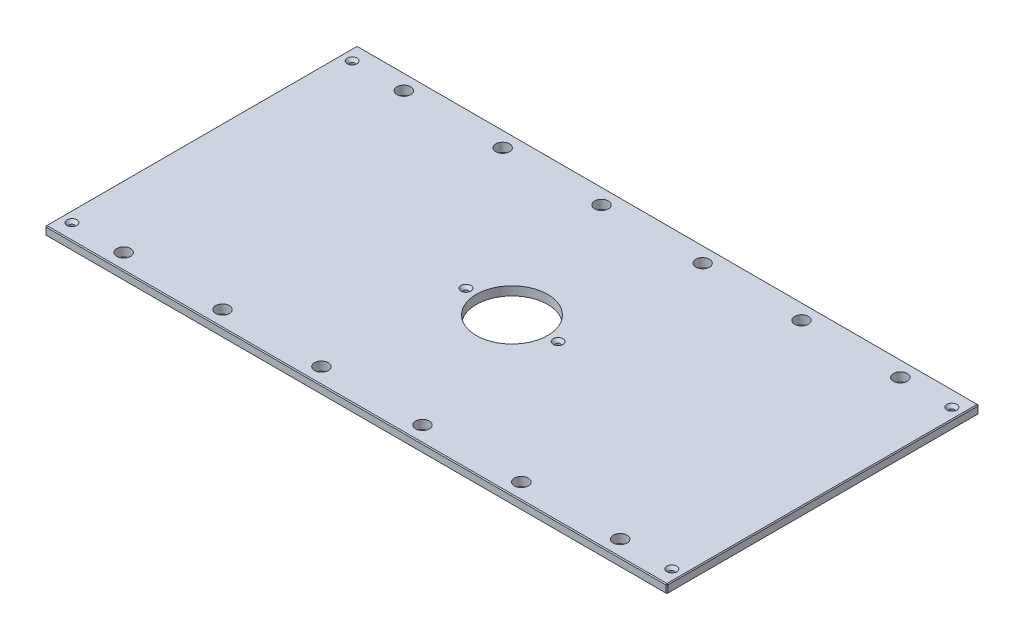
ISO-10303-21;
HEADER;
FILE_DESCRIPTION(('STEP AP214'),'2;1');
FILE_NAME('part.step','',(''),(''),'','','');
FILE_SCHEMA(('AUTOMOTIVE_DESIGN { 1 0 10303 214 1 1 1 1 }'));
ENDSEC;
DATA;
#1=APPLICATION_CONTEXT('core data for automotive mechanical design processes');
#2=APPLICATION_PROTOCOL_DEFINITION('international standard','automotive_design',2000,#1);
#3=PRODUCT_CONTEXT('',#1,'mechanical');
#4=PRODUCT('Part','Part','',(#3));
#5=PRODUCT_RELATED_PRODUCT_CATEGORY('part','',(#4));
#6=PRODUCT_DEFINITION_FORMATION('','',#4);
#7=PRODUCT_DEFINITION_CONTEXT('part definition',#1,'design');
#8=PRODUCT_DEFINITION('design','',#6,#7);
#9=PRODUCT_DEFINITION_SHAPE('','',#8);
#10=(LENGTH_UNIT() NAMED_UNIT(*) SI_UNIT(.MILLI.,.METRE.));
#11=(NAMED_UNIT(*) PLANE_ANGLE_UNIT() SI_UNIT($,.RADIAN.));
#12=(NAMED_UNIT(*) SI_UNIT($,.STERADIAN.) SOLID_ANGLE_UNIT());
#13=UNCERTAINTY_MEASURE_WITH_UNIT(LENGTH_MEASURE(1.E-05),#10,'distance_accuracy_value','');
#14=(GEOMETRIC_REPRESENTATION_CONTEXT(3) GLOBAL_UNCERTAINTY_ASSIGNED_CONTEXT((#13)) GLOBAL_UNIT_ASSIGNED_CONTEXT((#10,
#11,#12)) REPRESENTATION_CONTEXT('',''));
#15=CARTESIAN_POINT('',(0.,0.,0.));
#16=DIRECTION('',(0.,0.,1.));
#17=DIRECTION('',(1.,0.,0.));
#18=AXIS2_PLACEMENT_3D('',#15,#16,#17);
#19=CARTESIAN_POINT('',(-449.2625,12.7,-225.425));
#20=DIRECTION('',(1.,0.,0.));
#21=DIRECTION('',(0.,0.,-1.));
#22=AXIS2_PLACEMENT_3D('',#19,#20,#21);
#23=PLANE('',#22);
#24=DIRECTION('',(0.,0.,-1.));
#25=VECTOR('',#24,1.);
#26=CARTESIAN_POINT('',(-449.2625,11.43,-225.425));
#27=LINE('',#26,#25);
#28=CARTESIAN_POINT('',(-449.2625,11.43,224.155));
#29=VERTEX_POINT('',#28);
#30=CARTESIAN_POINT('',(-449.2625,11.43,-224.155));
#31=VERTEX_POINT('',#30);
#32=EDGE_CURVE('E134',#29,#31,#27,.T.);
#33=ORIENTED_EDGE('',*,*,#32,.T.);
#34=DIRECTION('',(0.,-1.,0.));
#35=VECTOR('',#34,1.);
#36=CARTESIAN_POINT('',(-449.2625,12.7,-224.155));
#37=LINE('',#36,#35);
#38=CARTESIAN_POINT('',(-449.2625,1.26999999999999,-224.155));
#39=VERTEX_POINT('',#38);
#40=EDGE_CURVE('E130',#31,#39,#37,.T.);
#41=ORIENTED_EDGE('',*,*,#40,.T.);
#42=DIRECTION('',(0.,0.,1.));
#43=VECTOR('',#42,1.);
#44=CARTESIAN_POINT('',(-449.2625,1.26999999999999,-225.425));
#45=LINE('',#44,#43);
#46=CARTESIAN_POINT('',(-449.2625,1.26999999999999,224.155));
#47=VERTEX_POINT('',#46);
#48=EDGE_CURVE('E125',#39,#47,#45,.T.);
#49=ORIENTED_EDGE('',*,*,#48,.T.);
#50=DIRECTION('',(0.,1.,0.));
#51=VECTOR('',#50,1.);
#52=CARTESIAN_POINT('',(-449.2625,12.7,224.155));
#53=LINE('',#52,#51);
#54=EDGE_CURVE('E127',#47,#29,#53,.T.);
#55=ORIENTED_EDGE('',*,*,#54,.T.);
#56=EDGE_LOOP('',(#33,#41,#49,#55));
#57=FACE_BOUND('',#56,.T.);
#58=ADVANCED_FACE('F34',(#57),#23,.F.);
#59=CARTESIAN_POINT('',(-449.2625,12.7,225.425));
#60=DIRECTION('',(0.,0.,-1.));
#61=DIRECTION('',(-1.,0.,0.));
#62=AXIS2_PLACEMENT_3D('',#59,#60,#61);
#63=PLANE('',#62);
#64=DIRECTION('',(1.,0.,0.));
#65=VECTOR('',#64,1.);
#66=CARTESIAN_POINT('',(-449.2625,1.26999999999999,225.425));
#67=LINE('',#66,#65);
#68=CARTESIAN_POINT('',(-447.9925,1.26999999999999,225.425));
#69=VERTEX_POINT('',#68);
#70=CARTESIAN_POINT('',(447.9925,1.26999999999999,225.425));
#71=VERTEX_POINT('',#70);
#72=EDGE_CURVE('E57',#69,#71,#67,.T.);
#73=ORIENTED_EDGE('',*,*,#72,.T.);
#74=DIRECTION('',(0.,1.,0.));
#75=VECTOR('',#74,1.);
#76=CARTESIAN_POINT('',(447.9925,12.7,225.425));
#77=LINE('',#76,#75);
#78=CARTESIAN_POINT('',(447.9925,11.43,225.425));
#79=VERTEX_POINT('',#78);
#80=EDGE_CURVE('E11',#71,#79,#77,.T.);
#81=ORIENTED_EDGE('',*,*,#80,.T.);
#82=DIRECTION('',(-1.,0.,0.));
#83=VECTOR('',#82,1.);
#84=CARTESIAN_POINT('',(-449.2625,11.43,225.425));
#85=LINE('',#84,#83);
#86=CARTESIAN_POINT('',(-447.9925,11.43,225.425));
#87=VERTEX_POINT('',#86);
#88=EDGE_CURVE('E43',#79,#87,#85,.T.);
#89=ORIENTED_EDGE('',*,*,#88,.T.);
#90=DIRECTION('',(0.,-1.,0.));
#91=VECTOR('',#90,1.);
#92=CARTESIAN_POINT('',(-447.9925,12.7,225.425));
#93=LINE('',#92,#91);
#94=EDGE_CURVE('E326',#87,#69,#93,.T.);
#95=ORIENTED_EDGE('',*,*,#94,.T.);
#96=EDGE_LOOP('',(#73,#81,#89,#95));
#97=FACE_BOUND('',#96,.T.);
#98=ADVANCED_FACE('F395',(#97),#63,.F.);
#99=CARTESIAN_POINT('',(449.2625,12.7,-225.425));
#100=DIRECTION('',(-1.,0.,0.));
#101=DIRECTION('',(0.,0.,1.));
#102=AXIS2_PLACEMENT_3D('',#99,#100,#101);
#103=PLANE('',#102);
#104=DIRECTION('',(0.,0.,-1.));
#105=VECTOR('',#104,1.);
#106=CARTESIAN_POINT('',(449.2625,1.26999999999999,-225.425));
#107=LINE('',#106,#105);
#108=CARTESIAN_POINT('',(449.2625,1.26999999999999,224.155));
#109=VERTEX_POINT('',#108);
#110=CARTESIAN_POINT('',(449.2625,1.26999999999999,-224.155));
#111=VERTEX_POINT('',#110);
#112=EDGE_CURVE('E321',#109,#111,#107,.T.);
#113=ORIENTED_EDGE('',*,*,#112,.T.);
#114=DIRECTION('',(0.,1.,0.));
#115=VECTOR('',#114,1.);
#116=CARTESIAN_POINT('',(449.2625,12.7,-224.155));
#117=LINE('',#116,#115);
#118=CARTESIAN_POINT('',(449.2625,11.43,-224.155));
#119=VERTEX_POINT('',#118);
#120=EDGE_CURVE('E323',#111,#119,#117,.T.);
#121=ORIENTED_EDGE('',*,*,#120,.T.);
#122=DIRECTION('',(0.,0.,1.));
#123=VECTOR('',#122,1.);
#124=CARTESIAN_POINT('',(449.2625,11.43,225.425));
#125=LINE('',#124,#123);
#126=CARTESIAN_POINT('',(449.2625,11.43,224.155));
#127=VERTEX_POINT('',#126);
#128=EDGE_CURVE('E319',#119,#127,#125,.T.);
#129=ORIENTED_EDGE('',*,*,#128,.T.);
#130=DIRECTION('',(0.,-1.,0.));
#131=VECTOR('',#130,1.);
#132=CARTESIAN_POINT('',(449.2625,12.7,224.155));
#133=LINE('',#132,#131);
#134=EDGE_CURVE('E317',#127,#109,#133,.T.);
#135=ORIENTED_EDGE('',*,*,#134,.T.);
#136=EDGE_LOOP('',(#113,#121,#129,#135));
#137=FACE_BOUND('',#136,.T.);
#138=ADVANCED_FACE('F382',(#137),#103,.F.);
#139=CARTESIAN_POINT('',(-449.2625,12.7,-225.425));
#140=DIRECTION('',(0.,0.,1.));
#141=DIRECTION('',(1.,0.,0.));
#142=AXIS2_PLACEMENT_3D('',#139,#140,#141);
#143=PLANE('',#142);
#144=DIRECTION('',(-1.,0.,0.));
#145=VECTOR('',#144,1.);
#146=CARTESIAN_POINT('',(-449.2625,1.26999999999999,-225.425));
#147=LINE('',#146,#145);
#148=CARTESIAN_POINT('',(447.9925,1.26999999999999,-225.425));
#149=VERTEX_POINT('',#148);
#150=CARTESIAN_POINT('',(-447.9925,1.26999999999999,-225.425));
#151=VERTEX_POINT('',#150);
#152=EDGE_CURVE('E293',#149,#151,#147,.T.);
#153=ORIENTED_EDGE('',*,*,#152,.T.);
#154=DIRECTION('',(0.,1.,0.));
#155=VECTOR('',#154,1.);
#156=CARTESIAN_POINT('',(-447.9925,12.7,-225.425));
#157=LINE('',#156,#155);
#158=CARTESIAN_POINT('',(-447.9925,11.43,-225.425));
#159=VERTEX_POINT('',#158);
#160=EDGE_CURVE('E297',#151,#159,#157,.T.);
#161=ORIENTED_EDGE('',*,*,#160,.T.);
#162=DIRECTION('',(1.,0.,0.));
#163=VECTOR('',#162,1.);
#164=CARTESIAN_POINT('',(449.2625,11.43,-225.425));
#165=LINE('',#164,#163);
#166=CARTESIAN_POINT('',(447.9925,11.43,-225.425));
#167=VERTEX_POINT('',#166);
#168=EDGE_CURVE('E295',#159,#167,#165,.T.);
#169=ORIENTED_EDGE('',*,*,#168,.T.);
#170=DIRECTION('',(0.,-1.,0.));
#171=VECTOR('',#170,1.);
#172=CARTESIAN_POINT('',(447.9925,12.7,-225.425));
#173=LINE('',#172,#171);
#174=EDGE_CURVE('E291',#167,#149,#173,.T.);
#175=ORIENTED_EDGE('',*,*,#174,.T.);
#176=EDGE_LOOP('',(#153,#161,#169,#175));
#177=FACE_BOUND('',#176,.T.);
#178=ADVANCED_FACE('F356',(#177),#143,.F.);
#179=CARTESIAN_POINT('',(0.,12.7,0.));
#180=DIRECTION('',(0.,1.,0.));
#181=DIRECTION('',(0.,0.,1.));
#182=AXIS2_PLACEMENT_3D('',#179,#180,#181);
#183=PLANE('',#182);
#184=CARTESIAN_POINT('',(433.3875,12.7,-202.40498));
#185=DIRECTION('',(0.,1.,0.));
#186=DIRECTION('',(0.,0.,1.));
#187=AXIS2_PLACEMENT_3D('',#184,#185,#186);
#188=CIRCLE('',#187,7.13740000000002);
#189=CARTESIAN_POINT('',(433.3875,12.7,-195.26758));
#190=VERTEX_POINT('',#189);
#191=EDGE_CURVE('E879',#190,#190,#188,.T.);
#192=ORIENTED_EDGE('',*,*,#191,.F.);
#193=EDGE_LOOP('',(#192));
#194=FACE_BOUND('',#193,.T.);
#195=CARTESIAN_POINT('',(433.3875,12.7,202.40498));
#196=DIRECTION('',(0.,1.,0.));
#197=DIRECTION('',(0.,0.,1.));
#198=AXIS2_PLACEMENT_3D('',#195,#196,#197);
#199=CIRCLE('',#198,7.13740000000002);
#200=CARTESIAN_POINT('',(433.3875,12.7,209.54238));
#201=VERTEX_POINT('',#200);
#202=EDGE_CURVE('E883',#201,#201,#199,.T.);
#203=ORIENTED_EDGE('',*,*,#202,.F.);
#204=EDGE_LOOP('',(#203));
#205=FACE_BOUND('',#204,.T.);
#206=CARTESIAN_POINT('',(-433.3875,12.7,202.40498));
#207=DIRECTION('',(0.,1.,0.));
#208=DIRECTION('',(0.,0.,1.));
#209=AXIS2_PLACEMENT_3D('',#206,#207,#208);
#210=CIRCLE('',#209,7.13740000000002);
#211=CARTESIAN_POINT('',(-433.3875,12.7,209.54238));
#212=VERTEX_POINT('',#211);
#213=EDGE_CURVE('E887',#212,#212,#210,.T.);
#214=ORIENTED_EDGE('',*,*,#213,.F.);
#215=EDGE_LOOP('',(#214));
#216=FACE_BOUND('',#215,.T.);
#217=CARTESIAN_POINT('',(-66.675,12.7,0.));
#218=DIRECTION('',(0.,1.,0.));
#219=DIRECTION('',(0.,0.,1.));
#220=AXIS2_PLACEMENT_3D('',#217,#218,#219);
#221=CIRCLE('',#220,7.1374);
#222=CARTESIAN_POINT('',(-66.675,12.7,7.1374));
#223=VERTEX_POINT('',#222);
#224=EDGE_CURVE('E891',#223,#223,#221,.T.);
#225=ORIENTED_EDGE('',*,*,#224,.F.);
#226=EDGE_LOOP('',(#225));
#227=FACE_BOUND('',#226,.T.);
#228=CARTESIAN_POINT('',(66.675,12.7,0.));
#229=DIRECTION('',(0.,1.,0.));
#230=DIRECTION('',(0.,0.,1.));
#231=AXIS2_PLACEMENT_3D('',#228,#229,#230);
#232=CIRCLE('',#231,7.1374);
#233=CARTESIAN_POINT('',(66.675,12.7,7.1374));
#234=VERTEX_POINT('',#233);
#235=EDGE_CURVE('E895',#234,#234,#232,.T.);
#236=ORIENTED_EDGE('',*,*,#235,.F.);
#237=EDGE_LOOP('',(#236));
#238=FACE_BOUND('',#237,.T.);
#239=CARTESIAN_POINT('',(-433.3875,12.7,-202.40498));
#240=DIRECTION('',(0.,1.,0.));
#241=DIRECTION('',(0.,0.,1.));
#242=AXIS2_PLACEMENT_3D('',#239,#240,#241);
#243=CIRCLE('',#242,7.13740000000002);
#244=CARTESIAN_POINT('',(-433.3875,12.7,-195.26758));
#245=VERTEX_POINT('',#244);
#246=EDGE_CURVE('E898',#245,#245,#243,.T.);
#247=ORIENTED_EDGE('',*,*,#246,.F.);
#248=EDGE_LOOP('',(#247));
#249=FACE_BOUND('',#248,.T.);
#250=DIRECTION('',(0.,0.,-1.));
#251=VECTOR('',#250,1.);
#252=CARTESIAN_POINT('',(447.9925,12.7,-225.425));
#253=LINE('',#252,#251);
#254=CARTESIAN_POINT('',(447.9925,12.7,224.155));
#255=VERTEX_POINT('',#254);
#256=CARTESIAN_POINT('',(447.9925,12.7,-224.155));
#257=VERTEX_POINT('',#256);
#258=EDGE_CURVE('E304',#255,#257,#253,.T.);
#259=ORIENTED_EDGE('',*,*,#258,.T.);
#260=DIRECTION('',(-1.,0.,0.));
#261=VECTOR('',#260,1.);
#262=CARTESIAN_POINT('',(-449.2625,12.7,-224.155));
#263=LINE('',#262,#261);
#264=CARTESIAN_POINT('',(-447.9925,12.7,-224.155));
#265=VERTEX_POINT('',#264);
#266=EDGE_CURVE('E306',#257,#265,#263,.T.);
#267=ORIENTED_EDGE('',*,*,#266,.T.);
#268=DIRECTION('',(0.,0.,1.));
#269=VECTOR('',#268,1.);
#270=CARTESIAN_POINT('',(-447.9925,12.7,225.425));
#271=LINE('',#270,#269);
#272=CARTESIAN_POINT('',(-447.9925,12.7,224.155));
#273=VERTEX_POINT('',#272);
#274=EDGE_CURVE('E302',#265,#273,#271,.T.);
#275=ORIENTED_EDGE('',*,*,#274,.T.);
#276=DIRECTION('',(1.,0.,0.));
#277=VECTOR('',#276,1.);
#278=CARTESIAN_POINT('',(449.2625,12.7,224.155));
#279=LINE('',#278,#277);
#280=EDGE_CURVE('E300',#273,#255,#279,.T.);
#281=ORIENTED_EDGE('',*,*,#280,.T.);
#282=EDGE_LOOP('',(#259,#267,#275,#281));
#283=FACE_BOUND('',#282,.T.);
#284=CARTESIAN_POINT('',(358.775,12.7,-202.40498));
#285=DIRECTION('',(0.,1.,0.));
#286=DIRECTION('',(0.,0.,1.));
#287=AXIS2_PLACEMENT_3D('',#284,#285,#286);
#288=CIRCLE('',#287,9.92187500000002);
#289=CARTESIAN_POINT('',(358.775,12.7,-192.483105));
#290=VERTEX_POINT('',#289);
#291=EDGE_CURVE('E203',#290,#290,#288,.T.);
#292=ORIENTED_EDGE('',*,*,#291,.F.);
#293=EDGE_LOOP('',(#292));
#294=FACE_BOUND('',#293,.T.);
#295=CARTESIAN_POINT('',(-358.775,12.7,-202.40498));
#296=DIRECTION('',(0.,1.,0.));
#297=DIRECTION('',(0.,0.,1.));
#298=AXIS2_PLACEMENT_3D('',#295,#296,#297);
#299=CIRCLE('',#298,9.92187500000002);
#300=CARTESIAN_POINT('',(-358.775,12.7,-192.483105));
#301=VERTEX_POINT('',#300);
#302=EDGE_CURVE('E213',#301,#301,#299,.T.);
#303=ORIENTED_EDGE('',*,*,#302,.F.);
#304=EDGE_LOOP('',(#303));
#305=FACE_BOUND('',#304,.T.);
#306=CARTESIAN_POINT('',(358.775,12.7,202.40498));
#307=DIRECTION('',(0.,1.,0.));
#308=DIRECTION('',(0.,0.,1.));
#309=AXIS2_PLACEMENT_3D('',#306,#307,#308);
#310=CIRCLE('',#309,9.92187500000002);
#311=CARTESIAN_POINT('',(358.775,12.7,212.326855));
#312=VERTEX_POINT('',#311);
#313=EDGE_CURVE('E224',#312,#312,#310,.T.);
#314=ORIENTED_EDGE('',*,*,#313,.F.);
#315=EDGE_LOOP('',(#314));
#316=FACE_BOUND('',#315,.T.);
#317=CARTESIAN_POINT('',(-358.775,12.7,202.40498));
#318=DIRECTION('',(0.,1.,0.));
#319=DIRECTION('',(0.,0.,1.));
#320=AXIS2_PLACEMENT_3D('',#317,#318,#319);
#321=CIRCLE('',#320,9.92187500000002);
#322=CARTESIAN_POINT('',(-358.775,12.7,212.326855));
#323=VERTEX_POINT('',#322);
#324=EDGE_CURVE('E230',#323,#323,#321,.T.);
#325=ORIENTED_EDGE('',*,*,#324,.F.);
#326=EDGE_LOOP('',(#325));
#327=FACE_BOUND('',#326,.T.);
#328=CARTESIAN_POINT('',(-215.9,12.7,-202.40498));
#329=DIRECTION('',(0.,1.,0.));
#330=DIRECTION('',(0.,0.,1.));
#331=AXIS2_PLACEMENT_3D('',#328,#329,#330);
#332=CIRCLE('',#331,9.921875);
#333=CARTESIAN_POINT('',(-215.9,12.7,-192.483105));
#334=VERTEX_POINT('',#333);
#335=EDGE_CURVE('E236',#334,#334,#332,.T.);
#336=ORIENTED_EDGE('',*,*,#335,.F.);
#337=EDGE_LOOP('',(#336));
#338=FACE_BOUND('',#337,.T.);
#339=CARTESIAN_POINT('',(215.9,12.7,-202.40498));
#340=DIRECTION('',(0.,1.,0.));
#341=DIRECTION('',(0.,0.,1.));
#342=AXIS2_PLACEMENT_3D('',#339,#340,#341);
#343=CIRCLE('',#342,9.921875);
#344=CARTESIAN_POINT('',(215.9,12.7,-192.483105));
#345=VERTEX_POINT('',#344);
#346=EDGE_CURVE('E242',#345,#345,#343,.T.);
#347=ORIENTED_EDGE('',*,*,#346,.F.);
#348=EDGE_LOOP('',(#347));
#349=FACE_BOUND('',#348,.T.);
#350=CARTESIAN_POINT('',(215.9,12.7,202.40498));
#351=DIRECTION('',(0.,1.,0.));
#352=DIRECTION('',(0.,0.,1.));
#353=AXIS2_PLACEMENT_3D('',#350,#351,#352);
#354=CIRCLE('',#353,9.921875);
#355=CARTESIAN_POINT('',(215.9,12.7,212.326855));
#356=VERTEX_POINT('',#355);
#357=EDGE_CURVE('E248',#356,#356,#354,.T.);
#358=ORIENTED_EDGE('',*,*,#357,.F.);
#359=EDGE_LOOP('',(#358));
#360=FACE_BOUND('',#359,.T.);
#361=CARTESIAN_POINT('',(-215.9,12.7,202.40498));
#362=DIRECTION('',(0.,1.,0.));
#363=DIRECTION('',(0.,0.,1.));
#364=AXIS2_PLACEMENT_3D('',#361,#362,#363);
#365=CIRCLE('',#364,9.921875);
#366=CARTESIAN_POINT('',(-215.9,12.7,212.326855));
#367=VERTEX_POINT('',#366);
#368=EDGE_CURVE('E254',#367,#367,#365,.T.);
#369=ORIENTED_EDGE('',*,*,#368,.F.);
#370=EDGE_LOOP('',(#369));
#371=FACE_BOUND('',#370,.T.);
#372=CARTESIAN_POINT('',(73.025,12.7,-202.40498));
#373=DIRECTION('',(0.,1.,0.));
#374=DIRECTION('',(0.,0.,1.));
#375=AXIS2_PLACEMENT_3D('',#372,#373,#374);
#376=CIRCLE('',#375,9.921875);
#377=CARTESIAN_POINT('',(73.025,12.7,-192.483105));
#378=VERTEX_POINT('',#377);
#379=EDGE_CURVE('E260',#378,#378,#376,.T.);
#380=ORIENTED_EDGE('',*,*,#379,.F.);
#381=EDGE_LOOP('',(#380));
#382=FACE_BOUND('',#381,.T.);
#383=CARTESIAN_POINT('',(-73.025,12.7,-202.40498));
#384=DIRECTION('',(0.,1.,0.));
#385=DIRECTION('',(0.,0.,1.));
#386=AXIS2_PLACEMENT_3D('',#383,#384,#385);
#387=CIRCLE('',#386,9.921875);
#388=CARTESIAN_POINT('',(-73.025,12.7,-192.483105));
#389=VERTEX_POINT('',#388);
#390=EDGE_CURVE('E266',#389,#389,#387,.T.);
#391=ORIENTED_EDGE('',*,*,#390,.F.);
#392=EDGE_LOOP('',(#391));
#393=FACE_BOUND('',#392,.T.);
#394=CARTESIAN_POINT('',(-73.025,12.7,202.40498));
#395=DIRECTION('',(0.,1.,0.));
#396=DIRECTION('',(0.,0.,1.));
#397=AXIS2_PLACEMENT_3D('',#394,#395,#396);
#398=CIRCLE('',#397,9.921875);
#399=CARTESIAN_POINT('',(-73.025,12.7,212.326855));
#400=VERTEX_POINT('',#399);
#401=EDGE_CURVE('E272',#400,#400,#398,.T.);
#402=ORIENTED_EDGE('',*,*,#401,.F.);
#403=EDGE_LOOP('',(#402));
#404=FACE_BOUND('',#403,.T.);
#405=CARTESIAN_POINT('',(73.025,12.7,202.40498));
#406=DIRECTION('',(0.,1.,0.));
#407=DIRECTION('',(0.,0.,1.));
#408=AXIS2_PLACEMENT_3D('',#405,#406,#407);
#409=CIRCLE('',#408,9.921875);
#410=CARTESIAN_POINT('',(73.025,12.7,212.326855));
#411=VERTEX_POINT('',#410);
#412=EDGE_CURVE('E278',#411,#411,#409,.T.);
#413=ORIENTED_EDGE('',*,*,#412,.F.);
#414=EDGE_LOOP('',(#413));
#415=FACE_BOUND('',#414,.T.);
#416=CARTESIAN_POINT('',(0.,12.7,0.));
#417=DIRECTION('',(0.,1.,0.));
#418=DIRECTION('',(0.,0.,1.));
#419=AXIS2_PLACEMENT_3D('',#416,#417,#418);
#420=CIRCLE('',#419,51.562);
#421=CARTESIAN_POINT('',(0.,12.7,51.562));
#422=VERTEX_POINT('',#421);
#423=EDGE_CURVE('E284',#422,#422,#420,.T.);
#424=ORIENTED_EDGE('',*,*,#423,.F.);
#425=EDGE_LOOP('',(#424));
#426=FACE_BOUND('',#425,.T.);
#427=ADVANCED_FACE('F404',(#194,#205,#216,#227,#238,#249,#283,#294,#305,#316,#327,#338,#349,
#360,#371,#382,#393,#404,#415,#426),#183,.T.);
#428=CARTESIAN_POINT('',(0.,0.,0.));
#429=DIRECTION('',(0.,1.,0.));
#430=DIRECTION('',(0.,0.,1.));
#431=AXIS2_PLACEMENT_3D('',#428,#429,#430);
#432=PLANE('',#431);
#433=CARTESIAN_POINT('',(433.3875,0.,-202.40498));
#434=DIRECTION('',(0.,1.,0.));
#435=DIRECTION('',(0.,0.,1.));
#436=AXIS2_PLACEMENT_3D('',#433,#434,#435);
#437=CIRCLE('',#436,3.3782);
#438=CARTESIAN_POINT('',(433.3875,0.,-199.02678));
#439=VERTEX_POINT('',#438);
#440=EDGE_CURVE('E932',#439,#439,#437,.T.);
#441=ORIENTED_EDGE('',*,*,#440,.T.);
#442=EDGE_LOOP('',(#441));
#443=FACE_BOUND('',#442,.T.);
#444=CARTESIAN_POINT('',(433.3875,0.,202.40498));
#445=DIRECTION('',(0.,1.,0.));
#446=DIRECTION('',(0.,0.,1.));
#447=AXIS2_PLACEMENT_3D('',#444,#445,#446);
#448=CIRCLE('',#447,3.3782);
#449=CARTESIAN_POINT('',(433.3875,0.,205.78318));
#450=VERTEX_POINT('',#449);
#451=EDGE_CURVE('E925',#450,#450,#448,.T.);
#452=ORIENTED_EDGE('',*,*,#451,.T.);
#453=EDGE_LOOP('',(#452));
#454=FACE_BOUND('',#453,.T.);
#455=CARTESIAN_POINT('',(-433.3875,0.,202.40498));
#456=DIRECTION('',(0.,1.,0.));
#457=DIRECTION('',(0.,0.,1.));
#458=AXIS2_PLACEMENT_3D('',#455,#456,#457);
#459=CIRCLE('',#458,3.3782);
#460=CARTESIAN_POINT('',(-433.3875,0.,205.78318));
#461=VERTEX_POINT('',#460);
#462=EDGE_CURVE('E918',#461,#461,#459,.T.);
#463=ORIENTED_EDGE('',*,*,#462,.T.);
#464=EDGE_LOOP('',(#463));
#465=FACE_BOUND('',#464,.T.);
#466=CARTESIAN_POINT('',(-66.675,0.,0.));
#467=DIRECTION('',(0.,1.,0.));
#468=DIRECTION('',(0.,0.,1.));
#469=AXIS2_PLACEMENT_3D('',#466,#467,#468);
#470=CIRCLE('',#469,3.3782);
#471=CARTESIAN_POINT('',(-66.675,0.,3.3782));
#472=VERTEX_POINT('',#471);
#473=EDGE_CURVE('E911',#472,#472,#470,.T.);
#474=ORIENTED_EDGE('',*,*,#473,.T.);
#475=EDGE_LOOP('',(#474));
#476=FACE_BOUND('',#475,.T.);
#477=CARTESIAN_POINT('',(66.675,0.,0.));
#478=DIRECTION('',(0.,1.,0.));
#479=DIRECTION('',(0.,0.,1.));
#480=AXIS2_PLACEMENT_3D('',#477,#478,#479);
#481=CIRCLE('',#480,3.3782);
#482=CARTESIAN_POINT('',(66.675,0.,3.3782));
#483=VERTEX_POINT('',#482);
#484=EDGE_CURVE('E901',#483,#483,#481,.T.);
#485=ORIENTED_EDGE('',*,*,#484,.T.);
#486=EDGE_LOOP('',(#485));
#487=FACE_BOUND('',#486,.T.);
#488=CARTESIAN_POINT('',(-433.3875,0.,-202.40498));
#489=DIRECTION('',(0.,1.,0.));
#490=DIRECTION('',(0.,0.,1.));
#491=AXIS2_PLACEMENT_3D('',#488,#489,#490);
#492=CIRCLE('',#491,3.3782);
#493=CARTESIAN_POINT('',(-433.3875,0.,-199.02678));
#494=VERTEX_POINT('',#493);
#495=EDGE_CURVE('E216',#494,#494,#492,.T.);
#496=ORIENTED_EDGE('',*,*,#495,.T.);
#497=EDGE_LOOP('',(#496));
#498=FACE_BOUND('',#497,.T.);
#499=DIRECTION('',(0.,0.,-1.));
#500=VECTOR('',#499,1.);
#501=CARTESIAN_POINT('',(-447.9925,0.,0.));
#502=LINE('',#501,#500);
#503=CARTESIAN_POINT('',(-447.9925,0.,224.155));
#504=VERTEX_POINT('',#503);
#505=CARTESIAN_POINT('',(-447.9925,0.,-224.155));
#506=VERTEX_POINT('',#505);
#507=EDGE_CURVE('E157',#504,#506,#502,.T.);
#508=ORIENTED_EDGE('',*,*,#507,.T.);
#509=DIRECTION('',(1.,0.,0.));
#510=VECTOR('',#509,1.);
#511=CARTESIAN_POINT('',(0.,0.,-224.155));
#512=LINE('',#511,#510);
#513=CARTESIAN_POINT('',(447.9925,0.,-224.155));
#514=VERTEX_POINT('',#513);
#515=EDGE_CURVE('E314',#506,#514,#512,.T.);
#516=ORIENTED_EDGE('',*,*,#515,.T.);
#517=DIRECTION('',(0.,0.,1.));
#518=VECTOR('',#517,1.);
#519=CARTESIAN_POINT('',(447.9925,0.,0.));
#520=LINE('',#519,#518);
#521=CARTESIAN_POINT('',(447.9925,0.,224.155));
#522=VERTEX_POINT('',#521);
#523=EDGE_CURVE('E312',#514,#522,#520,.T.);
#524=ORIENTED_EDGE('',*,*,#523,.T.);
#525=DIRECTION('',(-1.,0.,0.));
#526=VECTOR('',#525,1.);
#527=CARTESIAN_POINT('',(0.,0.,224.155));
#528=LINE('',#527,#526);
#529=EDGE_CURVE('E309',#522,#504,#528,.T.);
#530=ORIENTED_EDGE('',*,*,#529,.T.);
#531=EDGE_LOOP('',(#508,#516,#524,#530));
#532=FACE_BOUND('',#531,.T.);
#533=CARTESIAN_POINT('',(358.775,0.,-202.40498));
#534=DIRECTION('',(0.,1.,0.));
#535=DIRECTION('',(0.,0.,1.));
#536=AXIS2_PLACEMENT_3D('',#533,#534,#535);
#537=CIRCLE('',#536,9.92187500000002);
#538=CARTESIAN_POINT('',(358.775,0.,-192.483105));
#539=VERTEX_POINT('',#538);
#540=EDGE_CURVE('E208',#539,#539,#537,.T.);
#541=ORIENTED_EDGE('',*,*,#540,.T.);
#542=EDGE_LOOP('',(#541));
#543=FACE_BOUND('',#542,.T.);
#544=CARTESIAN_POINT('',(-358.775,0.,-202.40498));
#545=DIRECTION('',(0.,1.,0.));
#546=DIRECTION('',(0.,0.,1.));
#547=AXIS2_PLACEMENT_3D('',#544,#545,#546);
#548=CIRCLE('',#547,9.92187500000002);
#549=CARTESIAN_POINT('',(-358.775,0.,-192.483105));
#550=VERTEX_POINT('',#549);
#551=EDGE_CURVE('E221',#550,#550,#548,.T.);
#552=ORIENTED_EDGE('',*,*,#551,.T.);
#553=EDGE_LOOP('',(#552));
#554=FACE_BOUND('',#553,.T.);
#555=CARTESIAN_POINT('',(358.775,0.,202.40498));
#556=DIRECTION('',(0.,1.,0.));
#557=DIRECTION('',(0.,0.,1.));
#558=AXIS2_PLACEMENT_3D('',#555,#556,#557);
#559=CIRCLE('',#558,9.92187500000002);
#560=CARTESIAN_POINT('',(358.775,0.,212.326855));
#561=VERTEX_POINT('',#560);
#562=EDGE_CURVE('E227',#561,#561,#559,.T.);
#563=ORIENTED_EDGE('',*,*,#562,.T.);
#564=EDGE_LOOP('',(#563));
#565=FACE_BOUND('',#564,.T.);
#566=CARTESIAN_POINT('',(-358.775,0.,202.40498));
#567=DIRECTION('',(0.,1.,0.));
#568=DIRECTION('',(0.,0.,1.));
#569=AXIS2_PLACEMENT_3D('',#566,#567,#568);
#570=CIRCLE('',#569,9.92187500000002);
#571=CARTESIAN_POINT('',(-358.775,0.,212.326855));
#572=VERTEX_POINT('',#571);
#573=EDGE_CURVE('E233',#572,#572,#570,.T.);
#574=ORIENTED_EDGE('',*,*,#573,.T.);
#575=EDGE_LOOP('',(#574));
#576=FACE_BOUND('',#575,.T.);
#577=CARTESIAN_POINT('',(-215.9,0.,-202.40498));
#578=DIRECTION('',(0.,1.,0.));
#579=DIRECTION('',(0.,0.,1.));
#580=AXIS2_PLACEMENT_3D('',#577,#578,#579);
#581=CIRCLE('',#580,9.921875);
#582=CARTESIAN_POINT('',(-215.9,0.,-192.483105));
#583=VERTEX_POINT('',#582);
#584=EDGE_CURVE('E239',#583,#583,#581,.T.);
#585=ORIENTED_EDGE('',*,*,#584,.T.);
#586=EDGE_LOOP('',(#585));
#587=FACE_BOUND('',#586,.T.);
#588=CARTESIAN_POINT('',(215.9,0.,-202.40498));
#589=DIRECTION('',(0.,1.,0.));
#590=DIRECTION('',(0.,0.,1.));
#591=AXIS2_PLACEMENT_3D('',#588,#589,#590);
#592=CIRCLE('',#591,9.921875);
#593=CARTESIAN_POINT('',(215.9,0.,-192.483105));
#594=VERTEX_POINT('',#593);
#595=EDGE_CURVE('E245',#594,#594,#592,.T.);
#596=ORIENTED_EDGE('',*,*,#595,.T.);
#597=EDGE_LOOP('',(#596));
#598=FACE_BOUND('',#597,.T.);
#599=CARTESIAN_POINT('',(215.9,0.,202.40498));
#600=DIRECTION('',(0.,1.,0.));
#601=DIRECTION('',(0.,0.,1.));
#602=AXIS2_PLACEMENT_3D('',#599,#600,#601);
#603=CIRCLE('',#602,9.921875);
#604=CARTESIAN_POINT('',(215.9,0.,212.326855));
#605=VERTEX_POINT('',#604);
#606=EDGE_CURVE('E251',#605,#605,#603,.T.);
#607=ORIENTED_EDGE('',*,*,#606,.T.);
#608=EDGE_LOOP('',(#607));
#609=FACE_BOUND('',#608,.T.);
#610=CARTESIAN_POINT('',(-215.9,0.,202.40498));
#611=DIRECTION('',(0.,1.,0.));
#612=DIRECTION('',(0.,0.,1.));
#613=AXIS2_PLACEMENT_3D('',#610,#611,#612);
#614=CIRCLE('',#613,9.921875);
#615=CARTESIAN_POINT('',(-215.9,0.,212.326855));
#616=VERTEX_POINT('',#615);
#617=EDGE_CURVE('E257',#616,#616,#614,.T.);
#618=ORIENTED_EDGE('',*,*,#617,.T.);
#619=EDGE_LOOP('',(#618));
#620=FACE_BOUND('',#619,.T.);
#621=CARTESIAN_POINT('',(73.025,0.,-202.40498));
#622=DIRECTION('',(0.,1.,0.));
#623=DIRECTION('',(0.,0.,1.));
#624=AXIS2_PLACEMENT_3D('',#621,#622,#623);
#625=CIRCLE('',#624,9.921875);
#626=CARTESIAN_POINT('',(73.025,0.,-192.483105));
#627=VERTEX_POINT('',#626);
#628=EDGE_CURVE('E263',#627,#627,#625,.T.);
#629=ORIENTED_EDGE('',*,*,#628,.T.);
#630=EDGE_LOOP('',(#629));
#631=FACE_BOUND('',#630,.T.);
#632=CARTESIAN_POINT('',(-73.025,0.,-202.40498));
#633=DIRECTION('',(0.,1.,0.));
#634=DIRECTION('',(0.,0.,1.));
#635=AXIS2_PLACEMENT_3D('',#632,#633,#634);
#636=CIRCLE('',#635,9.921875);
#637=CARTESIAN_POINT('',(-73.025,0.,-192.483105));
#638=VERTEX_POINT('',#637);
#639=EDGE_CURVE('E269',#638,#638,#636,.T.);
#640=ORIENTED_EDGE('',*,*,#639,.T.);
#641=EDGE_LOOP('',(#640));
#642=FACE_BOUND('',#641,.T.);
#643=CARTESIAN_POINT('',(-73.025,0.,202.40498));
#644=DIRECTION('',(0.,1.,0.));
#645=DIRECTION('',(0.,0.,1.));
#646=AXIS2_PLACEMENT_3D('',#643,#644,#645);
#647=CIRCLE('',#646,9.921875);
#648=CARTESIAN_POINT('',(-73.025,0.,212.326855));
#649=VERTEX_POINT('',#648);
#650=EDGE_CURVE('E275',#649,#649,#647,.T.);
#651=ORIENTED_EDGE('',*,*,#650,.T.);
#652=EDGE_LOOP('',(#651));
#653=FACE_BOUND('',#652,.T.);
#654=CARTESIAN_POINT('',(73.025,0.,202.40498));
#655=DIRECTION('',(0.,1.,0.));
#656=DIRECTION('',(0.,0.,1.));
#657=AXIS2_PLACEMENT_3D('',#654,#655,#656);
#658=CIRCLE('',#657,9.921875);
#659=CARTESIAN_POINT('',(73.025,0.,212.326855));
#660=VERTEX_POINT('',#659);
#661=EDGE_CURVE('E281',#660,#660,#658,.T.);
#662=ORIENTED_EDGE('',*,*,#661,.T.);
#663=EDGE_LOOP('',(#662));
#664=FACE_BOUND('',#663,.T.);
#665=CARTESIAN_POINT('',(0.,0.,0.));
#666=DIRECTION('',(0.,1.,0.));
#667=DIRECTION('',(0.,0.,1.));
#668=AXIS2_PLACEMENT_3D('',#665,#666,#667);
#669=CIRCLE('',#668,51.562);
#670=CARTESIAN_POINT('',(0.,0.,51.562));
#671=VERTEX_POINT('',#670);
#672=EDGE_CURVE('E146',#671,#671,#669,.T.);
#673=ORIENTED_EDGE('',*,*,#672,.T.);
#674=EDGE_LOOP('',(#673));
#675=FACE_BOUND('',#674,.T.);
#676=ADVANCED_FACE('F369',(#443,#454,#465,#476,#487,#498,#532,#543,#554,#565,#576,#587,#598,
#609,#620,#631,#642,#653,#664,#675),#432,.F.);
#677=CARTESIAN_POINT('',(0.,0.,0.));
#678=DIRECTION('',(0.,1.,0.));
#679=DIRECTION('',(0.,0.,1.));
#680=AXIS2_PLACEMENT_3D('',#677,#678,#679);
#681=CYLINDRICAL_SURFACE('',#680,51.562);
#682=ORIENTED_EDGE('',*,*,#672,.F.);
#683=EDGE_LOOP('',(#682));
#684=FACE_BOUND('',#683,.T.);
#685=ORIENTED_EDGE('',*,*,#423,.T.);
#686=EDGE_LOOP('',(#685));
#687=FACE_BOUND('',#686,.T.);
#688=ADVANCED_FACE('F810',(#684,#687),#681,.F.);
#689=CARTESIAN_POINT('',(73.025,12.7,202.40498));
#690=DIRECTION('',(0.,1.,0.));
#691=DIRECTION('',(0.,0.,1.));
#692=AXIS2_PLACEMENT_3D('',#689,#690,#691);
#693=CYLINDRICAL_SURFACE('',#692,9.921875);
#694=ORIENTED_EDGE('',*,*,#661,.F.);
#695=EDGE_LOOP('',(#694));
#696=FACE_BOUND('',#695,.T.);
#697=ORIENTED_EDGE('',*,*,#412,.T.);
#698=EDGE_LOOP('',(#697));
#699=FACE_BOUND('',#698,.T.);
#700=ADVANCED_FACE('F801',(#696,#699),#693,.F.);
#701=CARTESIAN_POINT('',(-73.025,12.7,202.40498));
#702=DIRECTION('',(0.,1.,0.));
#703=DIRECTION('',(0.,0.,1.));
#704=AXIS2_PLACEMENT_3D('',#701,#702,#703);
#705=CYLINDRICAL_SURFACE('',#704,9.921875);
#706=ORIENTED_EDGE('',*,*,#650,.F.);
#707=EDGE_LOOP('',(#706));
#708=FACE_BOUND('',#707,.T.);
#709=ORIENTED_EDGE('',*,*,#401,.T.);
#710=EDGE_LOOP('',(#709));
#711=FACE_BOUND('',#710,.T.);
#712=ADVANCED_FACE('F792',(#708,#711),#705,.F.);
#713=CARTESIAN_POINT('',(-73.025,12.7,-202.40498));
#714=DIRECTION('',(0.,1.,0.));
#715=DIRECTION('',(0.,0.,1.));
#716=AXIS2_PLACEMENT_3D('',#713,#714,#715);
#717=CYLINDRICAL_SURFACE('',#716,9.921875);
#718=ORIENTED_EDGE('',*,*,#639,.F.);
#719=EDGE_LOOP('',(#718));
#720=FACE_BOUND('',#719,.T.);
#721=ORIENTED_EDGE('',*,*,#390,.T.);
#722=EDGE_LOOP('',(#721));
#723=FACE_BOUND('',#722,.T.);
#724=ADVANCED_FACE('F783',(#720,#723),#717,.F.);
#725=CARTESIAN_POINT('',(73.025,12.7,-202.40498));
#726=DIRECTION('',(0.,1.,0.));
#727=DIRECTION('',(0.,0.,1.));
#728=AXIS2_PLACEMENT_3D('',#725,#726,#727);
#729=CYLINDRICAL_SURFACE('',#728,9.921875);
#730=ORIENTED_EDGE('',*,*,#628,.F.);
#731=EDGE_LOOP('',(#730));
#732=FACE_BOUND('',#731,.T.);
#733=ORIENTED_EDGE('',*,*,#379,.T.);
#734=EDGE_LOOP('',(#733));
#735=FACE_BOUND('',#734,.T.);
#736=ADVANCED_FACE('F774',(#732,#735),#729,.F.);
#737=CARTESIAN_POINT('',(-215.9,12.7,202.40498));
#738=DIRECTION('',(0.,1.,0.));
#739=DIRECTION('',(0.,0.,1.));
#740=AXIS2_PLACEMENT_3D('',#737,#738,#739);
#741=CYLINDRICAL_SURFACE('',#740,9.921875);
#742=ORIENTED_EDGE('',*,*,#617,.F.);
#743=EDGE_LOOP('',(#742));
#744=FACE_BOUND('',#743,.T.);
#745=ORIENTED_EDGE('',*,*,#368,.T.);
#746=EDGE_LOOP('',(#745));
#747=FACE_BOUND('',#746,.T.);
#748=ADVANCED_FACE('F765',(#744,#747),#741,.F.);
#749=CARTESIAN_POINT('',(215.9,12.7,202.40498));
#750=DIRECTION('',(0.,1.,0.));
#751=DIRECTION('',(0.,0.,1.));
#752=AXIS2_PLACEMENT_3D('',#749,#750,#751);
#753=CYLINDRICAL_SURFACE('',#752,9.921875);
#754=ORIENTED_EDGE('',*,*,#606,.F.);
#755=EDGE_LOOP('',(#754));
#756=FACE_BOUND('',#755,.T.);
#757=ORIENTED_EDGE('',*,*,#357,.T.);
#758=EDGE_LOOP('',(#757));
#759=FACE_BOUND('',#758,.T.);
#760=ADVANCED_FACE('F756',(#756,#759),#753,.F.);
#761=CARTESIAN_POINT('',(215.9,12.7,-202.40498));
#762=DIRECTION('',(0.,1.,0.));
#763=DIRECTION('',(0.,0.,1.));
#764=AXIS2_PLACEMENT_3D('',#761,#762,#763);
#765=CYLINDRICAL_SURFACE('',#764,9.921875);
#766=ORIENTED_EDGE('',*,*,#595,.F.);
#767=EDGE_LOOP('',(#766));
#768=FACE_BOUND('',#767,.T.);
#769=ORIENTED_EDGE('',*,*,#346,.T.);
#770=EDGE_LOOP('',(#769));
#771=FACE_BOUND('',#770,.T.);
#772=ADVANCED_FACE('F747',(#768,#771),#765,.F.);
#773=CARTESIAN_POINT('',(-215.9,12.7,-202.40498));
#774=DIRECTION('',(0.,1.,0.));
#775=DIRECTION('',(0.,0.,1.));
#776=AXIS2_PLACEMENT_3D('',#773,#774,#775);
#777=CYLINDRICAL_SURFACE('',#776,9.921875);
#778=ORIENTED_EDGE('',*,*,#584,.F.);
#779=EDGE_LOOP('',(#778));
#780=FACE_BOUND('',#779,.T.);
#781=ORIENTED_EDGE('',*,*,#335,.T.);
#782=EDGE_LOOP('',(#781));
#783=FACE_BOUND('',#782,.T.);
#784=ADVANCED_FACE('F738',(#780,#783),#777,.F.);
#785=CARTESIAN_POINT('',(-358.775,12.7,202.40498));
#786=DIRECTION('',(0.,1.,0.));
#787=DIRECTION('',(0.,0.,1.));
#788=AXIS2_PLACEMENT_3D('',#785,#786,#787);
#789=CYLINDRICAL_SURFACE('',#788,9.92187500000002);
#790=ORIENTED_EDGE('',*,*,#573,.F.);
#791=EDGE_LOOP('',(#790));
#792=FACE_BOUND('',#791,.T.);
#793=ORIENTED_EDGE('',*,*,#324,.T.);
#794=EDGE_LOOP('',(#793));
#795=FACE_BOUND('',#794,.T.);
#796=ADVANCED_FACE('F729',(#792,#795),#789,.F.);
#797=CARTESIAN_POINT('',(358.775,12.7,202.40498));
#798=DIRECTION('',(0.,1.,0.));
#799=DIRECTION('',(0.,0.,1.));
#800=AXIS2_PLACEMENT_3D('',#797,#798,#799);
#801=CYLINDRICAL_SURFACE('',#800,9.92187500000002);
#802=ORIENTED_EDGE('',*,*,#562,.F.);
#803=EDGE_LOOP('',(#802));
#804=FACE_BOUND('',#803,.T.);
#805=ORIENTED_EDGE('',*,*,#313,.T.);
#806=EDGE_LOOP('',(#805));
#807=FACE_BOUND('',#806,.T.);
#808=ADVANCED_FACE('F720',(#804,#807),#801,.F.);
#809=CARTESIAN_POINT('',(-358.775,12.7,-202.40498));
#810=DIRECTION('',(0.,1.,0.));
#811=DIRECTION('',(0.,0.,1.));
#812=AXIS2_PLACEMENT_3D('',#809,#810,#811);
#813=CYLINDRICAL_SURFACE('',#812,9.92187500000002);
#814=ORIENTED_EDGE('',*,*,#551,.F.);
#815=EDGE_LOOP('',(#814));
#816=FACE_BOUND('',#815,.T.);
#817=ORIENTED_EDGE('',*,*,#302,.T.);
#818=EDGE_LOOP('',(#817));
#819=FACE_BOUND('',#818,.T.);
#820=ADVANCED_FACE('F710',(#816,#819),#813,.F.);
#821=CARTESIAN_POINT('',(358.775,12.7,-202.40498));
#822=DIRECTION('',(0.,1.,0.));
#823=DIRECTION('',(0.,0.,1.));
#824=AXIS2_PLACEMENT_3D('',#821,#822,#823);
#825=CYLINDRICAL_SURFACE('',#824,9.92187500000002);
#826=ORIENTED_EDGE('',*,*,#540,.F.);
#827=EDGE_LOOP('',(#826));
#828=FACE_BOUND('',#827,.T.);
#829=ORIENTED_EDGE('',*,*,#291,.T.);
#830=EDGE_LOOP('',(#829));
#831=FACE_BOUND('',#830,.T.);
#832=ADVANCED_FACE('F413',(#828,#831),#825,.F.);
#833=CARTESIAN_POINT('',(449.2625,12.7,224.155));
#834=DIRECTION('',(-0.707106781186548,0.,-0.707106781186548));
#835=DIRECTION('',(0.,-1.,0.));
#836=AXIS2_PLACEMENT_3D('',#833,#834,#835);
#837=PLANE('',#836);
#838=DIRECTION('',(-0.707106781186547,0.,0.707106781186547));
#839=VECTOR('',#838,1.);
#840=CARTESIAN_POINT('',(449.2625,11.43,224.155));
#841=LINE('',#840,#839);
#842=EDGE_CURVE('E38',#79,#127,#841,.F.);
#843=ORIENTED_EDGE('',*,*,#842,.F.);
#844=ORIENTED_EDGE('',*,*,#80,.F.);
#845=DIRECTION('',(0.707106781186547,0.,-0.707106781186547));
#846=VECTOR('',#845,1.);
#847=CARTESIAN_POINT('',(448.6275,1.26999999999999,224.79));
#848=LINE('',#847,#846);
#849=EDGE_CURVE('E196',#109,#71,#848,.F.);
#850=ORIENTED_EDGE('',*,*,#849,.F.);
#851=ORIENTED_EDGE('',*,*,#134,.F.);
#852=EDGE_LOOP('',(#843,#844,#850,#851));
#853=FACE_BOUND('',#852,.T.);
#854=ADVANCED_FACE('F36',(#853),#837,.F.);
#855=CARTESIAN_POINT('',(449.2625,11.43,224.155));
#856=DIRECTION('',(0.577350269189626,0.577350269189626,0.577350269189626));
#857=DIRECTION('',(0.707106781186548,0.,-0.707106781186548));
#858=AXIS2_PLACEMENT_3D('',#855,#856,#857);
#859=PLANE('',#858);
#860=DIRECTION('',(0.,-0.707106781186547,0.707106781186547));
#861=VECTOR('',#860,1.);
#862=CARTESIAN_POINT('',(447.9925,12.065,224.79));
#863=LINE('',#862,#861);
#864=EDGE_CURVE('E192',#79,#255,#863,.F.);
#865=ORIENTED_EDGE('',*,*,#864,.F.);
#866=ORIENTED_EDGE('',*,*,#842,.T.);
#867=DIRECTION('',(-0.707106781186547,0.707106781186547,0.));
#868=VECTOR('',#867,1.);
#869=CARTESIAN_POINT('',(449.2625,11.43,224.155));
#870=LINE('',#869,#868);
#871=EDGE_CURVE('E194',#255,#127,#870,.F.);
#872=ORIENTED_EDGE('',*,*,#871,.F.);
#873=EDGE_LOOP('',(#865,#866,#872));
#874=FACE_BOUND('',#873,.T.);
#875=ADVANCED_FACE('F406',(#874),#859,.T.);
#876=CARTESIAN_POINT('',(447.9925,0.,224.155));
#877=DIRECTION('',(0.577350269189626,-0.577350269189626,0.577350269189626));
#878=DIRECTION('',(0.707106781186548,0.,-0.707106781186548));
#879=AXIS2_PLACEMENT_3D('',#876,#877,#878);
#880=PLANE('',#879);
#881=DIRECTION('',(-0.707106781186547,-0.707106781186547,0.));
#882=VECTOR('',#881,1.);
#883=CARTESIAN_POINT('',(447.9925,0.,224.155));
#884=LINE('',#883,#882);
#885=EDGE_CURVE('E186',#109,#522,#884,.T.);
#886=ORIENTED_EDGE('',*,*,#885,.F.);
#887=ORIENTED_EDGE('',*,*,#849,.T.);
#888=DIRECTION('',(0.,0.707106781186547,0.707106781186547));
#889=VECTOR('',#888,1.);
#890=CARTESIAN_POINT('',(447.9925,0.,224.155));
#891=LINE('',#890,#889);
#892=EDGE_CURVE('E189',#522,#71,#891,.T.);
#893=ORIENTED_EDGE('',*,*,#892,.F.);
#894=EDGE_LOOP('',(#886,#887,#893));
#895=FACE_BOUND('',#894,.T.);
#896=ADVANCED_FACE('F375',(#895),#880,.T.);
#897=CARTESIAN_POINT('',(447.9925,12.7,0.));
#898=DIRECTION('',(0.707106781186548,0.707106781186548,0.));
#899=DIRECTION('',(0.,0.,1.));
#900=AXIS2_PLACEMENT_3D('',#897,#898,#899);
#901=PLANE('',#900);
#902=ORIENTED_EDGE('',*,*,#871,.T.);
#903=ORIENTED_EDGE('',*,*,#128,.F.);
#904=DIRECTION('',(0.707106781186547,-0.707106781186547,0.));
#905=VECTOR('',#904,1.);
#906=CARTESIAN_POINT('',(448.6275,12.065,-224.155));
#907=LINE('',#906,#905);
#908=EDGE_CURVE('E181',#257,#119,#907,.T.);
#909=ORIENTED_EDGE('',*,*,#908,.F.);
#910=ORIENTED_EDGE('',*,*,#258,.F.);
#911=EDGE_LOOP('',(#902,#903,#909,#910));
#912=FACE_BOUND('',#911,.T.);
#913=ADVANCED_FACE('F392',(#912),#901,.T.);
#914=CARTESIAN_POINT('',(0.,12.7,224.155));
#915=DIRECTION('',(0.,0.707106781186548,0.707106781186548));
#916=DIRECTION('',(-1.,0.,0.));
#917=AXIS2_PLACEMENT_3D('',#914,#915,#916);
#918=PLANE('',#917);
#919=ORIENTED_EDGE('',*,*,#864,.T.);
#920=ORIENTED_EDGE('',*,*,#280,.F.);
#921=DIRECTION('',(0.,0.707106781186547,-0.707106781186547));
#922=VECTOR('',#921,1.);
#923=CARTESIAN_POINT('',(-447.9925,12.7,224.155));
#924=LINE('',#923,#922);
#925=EDGE_CURVE('E178',#87,#273,#924,.T.);
#926=ORIENTED_EDGE('',*,*,#925,.F.);
#927=ORIENTED_EDGE('',*,*,#88,.F.);
#928=EDGE_LOOP('',(#919,#920,#926,#927));
#929=FACE_BOUND('',#928,.T.);
#930=ADVANCED_FACE('F397',(#929),#918,.T.);
#931=CARTESIAN_POINT('',(-447.9925,12.7,225.425));
#932=DIRECTION('',(0.707106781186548,0.,-0.707106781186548));
#933=DIRECTION('',(0.,-1.,0.));
#934=AXIS2_PLACEMENT_3D('',#931,#932,#933);
#935=PLANE('',#934);
#936=DIRECTION('',(0.707106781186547,0.,0.707106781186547));
#937=VECTOR('',#936,1.);
#938=CARTESIAN_POINT('',(-449.2625,1.26999999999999,224.155));
#939=LINE('',#938,#937);
#940=EDGE_CURVE('E141',#69,#47,#939,.F.);
#941=ORIENTED_EDGE('',*,*,#940,.F.);
#942=ORIENTED_EDGE('',*,*,#94,.F.);
#943=DIRECTION('',(-0.707106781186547,0.,-0.707106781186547));
#944=VECTOR('',#943,1.);
#945=CARTESIAN_POINT('',(-448.6275,11.43,224.79));
#946=LINE('',#945,#944);
#947=EDGE_CURVE('E144',#29,#87,#946,.F.);
#948=ORIENTED_EDGE('',*,*,#947,.F.);
#949=ORIENTED_EDGE('',*,*,#54,.F.);
#950=EDGE_LOOP('',(#941,#942,#948,#949));
#951=FACE_BOUND('',#950,.T.);
#952=ADVANCED_FACE('F139',(#951),#935,.F.);
#953=CARTESIAN_POINT('',(-449.2625,1.26999999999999,225.425));
#954=DIRECTION('',(0.,0.707106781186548,-0.707106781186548));
#955=DIRECTION('',(1.,0.,0.));
#956=AXIS2_PLACEMENT_3D('',#953,#954,#955);
#957=PLANE('',#956);
#958=ORIENTED_EDGE('',*,*,#892,.T.);
#959=ORIENTED_EDGE('',*,*,#72,.F.);
#960=DIRECTION('',(0.,-0.707106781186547,-0.707106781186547));
#961=VECTOR('',#960,1.);
#962=CARTESIAN_POINT('',(-447.9925,0.634999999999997,224.79));
#963=LINE('',#962,#961);
#964=EDGE_CURVE('E154',#504,#69,#963,.F.);
#965=ORIENTED_EDGE('',*,*,#964,.F.);
#966=ORIENTED_EDGE('',*,*,#529,.F.);
#967=EDGE_LOOP('',(#958,#959,#965,#966));
#968=FACE_BOUND('',#967,.T.);
#969=ADVANCED_FACE('F374',(#968),#957,.F.);
#970=CARTESIAN_POINT('',(449.2625,1.26999999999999,-225.425));
#971=DIRECTION('',(-0.707106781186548,0.707106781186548,0.));
#972=DIRECTION('',(0.,0.,-1.));
#973=AXIS2_PLACEMENT_3D('',#970,#971,#972);
#974=PLANE('',#973);
#975=ORIENTED_EDGE('',*,*,#885,.T.);
#976=ORIENTED_EDGE('',*,*,#523,.F.);
#977=DIRECTION('',(0.707106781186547,0.707106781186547,0.));
#978=VECTOR('',#977,1.);
#979=CARTESIAN_POINT('',(447.9925,0.,-224.155));
#980=LINE('',#979,#978);
#981=EDGE_CURVE('E173',#111,#514,#980,.F.);
#982=ORIENTED_EDGE('',*,*,#981,.F.);
#983=ORIENTED_EDGE('',*,*,#112,.F.);
#984=EDGE_LOOP('',(#975,#976,#982,#983));
#985=FACE_BOUND('',#984,.T.);
#986=ADVANCED_FACE('F379',(#985),#974,.F.);
#987=CARTESIAN_POINT('',(447.9925,12.7,-225.425));
#988=DIRECTION('',(-0.707106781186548,0.,0.707106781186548));
#989=DIRECTION('',(0.,-1.,0.));
#990=AXIS2_PLACEMENT_3D('',#987,#988,#989);
#991=PLANE('',#990);
#992=DIRECTION('',(0.707106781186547,0.,0.707106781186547));
#993=VECTOR('',#992,1.);
#994=CARTESIAN_POINT('',(447.9925,11.43,-225.425));
#995=LINE('',#994,#993);
#996=EDGE_CURVE('E183',#119,#167,#995,.F.);
#997=ORIENTED_EDGE('',*,*,#996,.F.);
#998=ORIENTED_EDGE('',*,*,#120,.F.);
#999=DIRECTION('',(-0.707106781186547,0.,-0.707106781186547));
#1000=VECTOR('',#999,1.);
#1001=CARTESIAN_POINT('',(448.6275,1.26999999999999,-224.79));
#1002=LINE('',#1001,#1000);
#1003=EDGE_CURVE('E170',#149,#111,#1002,.F.);
#1004=ORIENTED_EDGE('',*,*,#1003,.F.);
#1005=ORIENTED_EDGE('',*,*,#174,.F.);
#1006=EDGE_LOOP('',(#997,#998,#1004,#1005));
#1007=FACE_BOUND('',#1006,.T.);
#1008=ADVANCED_FACE('F387',(#1007),#991,.F.);
#1009=CARTESIAN_POINT('',(447.9925,11.43,-225.425));
#1010=DIRECTION('',(0.577350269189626,0.577350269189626,-0.577350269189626));
#1011=DIRECTION('',(-0.707106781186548,0.,-0.707106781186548));
#1012=AXIS2_PLACEMENT_3D('',#1009,#1010,#1011);
#1013=PLANE('',#1012);
#1014=ORIENTED_EDGE('',*,*,#908,.T.);
#1015=ORIENTED_EDGE('',*,*,#996,.T.);
#1016=DIRECTION('',(0.,0.707106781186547,0.707106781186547));
#1017=VECTOR('',#1016,1.);
#1018=CARTESIAN_POINT('',(447.9925,11.43,-225.425));
#1019=LINE('',#1018,#1017);
#1020=EDGE_CURVE('E162',#257,#167,#1019,.F.);
#1021=ORIENTED_EDGE('',*,*,#1020,.F.);
#1022=EDGE_LOOP('',(#1014,#1015,#1021));
#1023=FACE_BOUND('',#1022,.T.);
#1024=ADVANCED_FACE('F445',(#1023),#1013,.T.);
#1025=CARTESIAN_POINT('',(-447.9925,12.7,224.155));
#1026=DIRECTION('',(-0.577350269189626,0.577350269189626,0.577350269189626));
#1027=DIRECTION('',(0.707106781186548,0.,0.707106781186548));
#1028=AXIS2_PLACEMENT_3D('',#1025,#1026,#1027);
#1029=PLANE('',#1028);
#1030=ORIENTED_EDGE('',*,*,#947,.T.);
#1031=ORIENTED_EDGE('',*,*,#925,.T.);
#1032=DIRECTION('',(-0.707106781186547,-0.707106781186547,0.));
#1033=VECTOR('',#1032,1.);
#1034=CARTESIAN_POINT('',(-447.9925,12.7,224.155));
#1035=LINE('',#1034,#1033);
#1036=EDGE_CURVE('E158',#29,#273,#1035,.F.);
#1037=ORIENTED_EDGE('',*,*,#1036,.F.);
#1038=EDGE_LOOP('',(#1030,#1031,#1037));
#1039=FACE_BOUND('',#1038,.T.);
#1040=ADVANCED_FACE('F399',(#1039),#1029,.T.);
#1041=CARTESIAN_POINT('',(-449.2625,1.26999999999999,224.155));
#1042=DIRECTION('',(-0.577350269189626,-0.577350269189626,0.577350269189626));
#1043=DIRECTION('',(0.707106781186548,0.,0.707106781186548));
#1044=AXIS2_PLACEMENT_3D('',#1041,#1042,#1043);
#1045=PLANE('',#1044);
#1046=ORIENTED_EDGE('',*,*,#964,.T.);
#1047=ORIENTED_EDGE('',*,*,#940,.T.);
#1048=DIRECTION('',(-0.707106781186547,0.707106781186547,0.));
#1049=VECTOR('',#1048,1.);
#1050=CARTESIAN_POINT('',(-449.2625,1.26999999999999,224.155));
#1051=LINE('',#1050,#1049);
#1052=EDGE_CURVE('E151',#504,#47,#1051,.T.);
#1053=ORIENTED_EDGE('',*,*,#1052,.F.);
#1054=EDGE_LOOP('',(#1046,#1047,#1053));
#1055=FACE_BOUND('',#1054,.T.);
#1056=ADVANCED_FACE('F150',(#1055),#1045,.T.);
#1057=CARTESIAN_POINT('',(447.9925,0.,-224.155));
#1058=DIRECTION('',(0.577350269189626,-0.577350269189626,-0.577350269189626));
#1059=DIRECTION('',(-0.707106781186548,0.,-0.707106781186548));
#1060=AXIS2_PLACEMENT_3D('',#1057,#1058,#1059);
#1061=PLANE('',#1060);
#1062=ORIENTED_EDGE('',*,*,#1003,.T.);
#1063=ORIENTED_EDGE('',*,*,#981,.T.);
#1064=DIRECTION('',(0.,-0.707106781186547,0.707106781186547));
#1065=VECTOR('',#1064,1.);
#1066=CARTESIAN_POINT('',(447.9925,0.,-224.155));
#1067=LINE('',#1066,#1065);
#1068=EDGE_CURVE('E159',#149,#514,#1067,.T.);
#1069=ORIENTED_EDGE('',*,*,#1068,.F.);
#1070=EDGE_LOOP('',(#1062,#1063,#1069));
#1071=FACE_BOUND('',#1070,.T.);
#1072=ADVANCED_FACE('F437',(#1071),#1061,.T.);
#1073=CARTESIAN_POINT('',(0.,12.7,-224.155));
#1074=DIRECTION('',(0.,0.707106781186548,-0.707106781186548));
#1075=DIRECTION('',(1.,0.,0.));
#1076=AXIS2_PLACEMENT_3D('',#1073,#1074,#1075);
#1077=PLANE('',#1076);
#1078=ORIENTED_EDGE('',*,*,#1020,.T.);
#1079=ORIENTED_EDGE('',*,*,#168,.F.);
#1080=DIRECTION('',(0.,-0.707106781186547,-0.707106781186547));
#1081=VECTOR('',#1080,1.);
#1082=CARTESIAN_POINT('',(-447.9925,11.43,-225.425));
#1083=LINE('',#1082,#1081);
#1084=EDGE_CURVE('E164',#265,#159,#1083,.T.);
#1085=ORIENTED_EDGE('',*,*,#1084,.F.);
#1086=ORIENTED_EDGE('',*,*,#266,.F.);
#1087=EDGE_LOOP('',(#1078,#1079,#1085,#1086));
#1088=FACE_BOUND('',#1087,.T.);
#1089=ADVANCED_FACE('F351',(#1088),#1077,.T.);
#1090=CARTESIAN_POINT('',(-447.9925,12.7,0.));
#1091=DIRECTION('',(-0.707106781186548,0.707106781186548,0.));
#1092=DIRECTION('',(0.,0.,-1.));
#1093=AXIS2_PLACEMENT_3D('',#1090,#1091,#1092);
#1094=PLANE('',#1093);
#1095=ORIENTED_EDGE('',*,*,#1036,.T.);
#1096=ORIENTED_EDGE('',*,*,#274,.F.);
#1097=DIRECTION('',(0.707106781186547,0.707106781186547,0.));
#1098=VECTOR('',#1097,1.);
#1099=CARTESIAN_POINT('',(-448.6275,12.065,-224.155));
#1100=LINE('',#1099,#1098);
#1101=EDGE_CURVE('E340',#31,#265,#1100,.T.);
#1102=ORIENTED_EDGE('',*,*,#1101,.F.);
#1103=ORIENTED_EDGE('',*,*,#32,.F.);
#1104=EDGE_LOOP('',(#1095,#1096,#1102,#1103));
#1105=FACE_BOUND('',#1104,.T.);
#1106=ADVANCED_FACE('F402',(#1105),#1094,.T.);
#1107=CARTESIAN_POINT('',(-449.2625,1.26999999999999,-225.425));
#1108=DIRECTION('',(0.707106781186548,0.707106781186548,0.));
#1109=DIRECTION('',(0.,0.,1.));
#1110=AXIS2_PLACEMENT_3D('',#1107,#1108,#1109);
#1111=PLANE('',#1110);
#1112=ORIENTED_EDGE('',*,*,#1052,.T.);
#1113=ORIENTED_EDGE('',*,*,#48,.F.);
#1114=DIRECTION('',(0.707106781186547,-0.707106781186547,0.));
#1115=VECTOR('',#1114,1.);
#1116=CARTESIAN_POINT('',(-449.2625,1.26999999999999,-224.155));
#1117=LINE('',#1116,#1115);
#1118=EDGE_CURVE('E337',#506,#39,#1117,.F.);
#1119=ORIENTED_EDGE('',*,*,#1118,.F.);
#1120=ORIENTED_EDGE('',*,*,#507,.F.);
#1121=EDGE_LOOP('',(#1112,#1113,#1119,#1120));
#1122=FACE_BOUND('',#1121,.T.);
#1123=ADVANCED_FACE('F156',(#1122),#1111,.F.);
#1124=CARTESIAN_POINT('',(-449.2625,1.26999999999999,-225.425));
#1125=DIRECTION('',(0.,0.707106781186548,0.707106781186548));
#1126=DIRECTION('',(-1.,0.,0.));
#1127=AXIS2_PLACEMENT_3D('',#1124,#1125,#1126);
#1128=PLANE('',#1127);
#1129=ORIENTED_EDGE('',*,*,#1068,.T.);
#1130=ORIENTED_EDGE('',*,*,#515,.F.);
#1131=DIRECTION('',(0.,0.707106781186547,-0.707106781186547));
#1132=VECTOR('',#1131,1.);
#1133=CARTESIAN_POINT('',(-447.9925,0.634999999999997,-224.79));
#1134=LINE('',#1133,#1132);
#1135=EDGE_CURVE('E334',#151,#506,#1134,.F.);
#1136=ORIENTED_EDGE('',*,*,#1135,.F.);
#1137=ORIENTED_EDGE('',*,*,#152,.F.);
#1138=EDGE_LOOP('',(#1129,#1130,#1136,#1137));
#1139=FACE_BOUND('',#1138,.T.);
#1140=ADVANCED_FACE('F366',(#1139),#1128,.F.);
#1141=CARTESIAN_POINT('',(-447.9925,11.43,-225.425));
#1142=DIRECTION('',(-0.577350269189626,0.577350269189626,-0.577350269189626));
#1143=DIRECTION('',(-0.707106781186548,0.,0.707106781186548));
#1144=AXIS2_PLACEMENT_3D('',#1141,#1142,#1143);
#1145=PLANE('',#1144);
#1146=ORIENTED_EDGE('',*,*,#1101,.T.);
#1147=ORIENTED_EDGE('',*,*,#1084,.T.);
#1148=DIRECTION('',(0.707106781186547,0.,-0.707106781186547));
#1149=VECTOR('',#1148,1.);
#1150=CARTESIAN_POINT('',(-447.9925,11.43,-225.425));
#1151=LINE('',#1150,#1149);
#1152=EDGE_CURVE('E332',#31,#159,#1151,.T.);
#1153=ORIENTED_EDGE('',*,*,#1152,.F.);
#1154=EDGE_LOOP('',(#1146,#1147,#1153));
#1155=FACE_BOUND('',#1154,.T.);
#1156=ADVANCED_FACE('F346',(#1155),#1145,.T.);
#1157=CARTESIAN_POINT('',(-449.2625,1.26999999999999,-224.155));
#1158=DIRECTION('',(-0.577350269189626,-0.577350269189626,-0.577350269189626));
#1159=DIRECTION('',(-0.707106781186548,0.,0.707106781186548));
#1160=AXIS2_PLACEMENT_3D('',#1157,#1158,#1159);
#1161=PLANE('',#1160);
#1162=ORIENTED_EDGE('',*,*,#1135,.T.);
#1163=ORIENTED_EDGE('',*,*,#1118,.T.);
#1164=DIRECTION('',(-0.707106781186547,0.,0.707106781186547));
#1165=VECTOR('',#1164,1.);
#1166=CARTESIAN_POINT('',(-449.2625,1.26999999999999,-224.155));
#1167=LINE('',#1166,#1165);
#1168=EDGE_CURVE('E330',#151,#39,#1167,.T.);
#1169=ORIENTED_EDGE('',*,*,#1168,.F.);
#1170=EDGE_LOOP('',(#1162,#1163,#1169));
#1171=FACE_BOUND('',#1170,.T.);
#1172=ADVANCED_FACE('F363',(#1171),#1161,.T.);
#1173=CARTESIAN_POINT('',(-449.2625,12.7,-224.155));
#1174=DIRECTION('',(0.707106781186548,0.,0.707106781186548));
#1175=DIRECTION('',(0.,-1.,0.));
#1176=AXIS2_PLACEMENT_3D('',#1173,#1174,#1175);
#1177=PLANE('',#1176);
#1178=ORIENTED_EDGE('',*,*,#1152,.T.);
#1179=ORIENTED_EDGE('',*,*,#160,.F.);
#1180=ORIENTED_EDGE('',*,*,#1168,.T.);
#1181=ORIENTED_EDGE('',*,*,#40,.F.);
#1182=EDGE_LOOP('',(#1178,#1179,#1180,#1181));
#1183=FACE_BOUND('',#1182,.T.);
#1184=ADVANCED_FACE('F361',(#1183),#1177,.F.);
#1185=CARTESIAN_POINT('',(-433.3875,12.7,-202.40498));
#1186=DIRECTION('',(0.,1.,0.));
#1187=DIRECTION('',(0.,0.,1.));
#1188=AXIS2_PLACEMENT_3D('',#1185,#1186,#1187);
#1189=CYLINDRICAL_SURFACE('',#1188,3.3782);
#1190=ORIENTED_EDGE('',*,*,#495,.F.);
#1191=EDGE_LOOP('',(#1190));
#1192=FACE_BOUND('',#1191,.T.);
#1193=CARTESIAN_POINT('',(-433.3875,8.37553508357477,-202.40498));
#1194=DIRECTION('',(0.,1.,0.));
#1195=DIRECTION('',(0.,0.,1.));
#1196=AXIS2_PLACEMENT_3D('',#1193,#1194,#1195);
#1197=CIRCLE('',#1196,3.3782);
#1198=CARTESIAN_POINT('',(-433.3875,8.37553508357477,-199.02678));
#1199=VERTEX_POINT('',#1198);
#1200=EDGE_CURVE('E900',#1199,#1199,#1197,.T.);
#1201=ORIENTED_EDGE('',*,*,#1200,.T.);
#1202=EDGE_LOOP('',(#1201));
#1203=FACE_BOUND('',#1202,.T.);
#1204=ADVANCED_FACE('F424',(#1192,#1203),#1189,.F.);
#1205=CARTESIAN_POINT('',(-433.3875,12.7,-202.40498));
#1206=DIRECTION('',(0.,1.,0.));
#1207=DIRECTION('',(0.,0.,1.));
#1208=AXIS2_PLACEMENT_3D('',#1205,#1206,#1207);
#1209=CONICAL_SURFACE('',#1208,7.13740000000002,0.715584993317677);
#1210=ORIENTED_EDGE('',*,*,#1200,.F.);
#1211=EDGE_LOOP('',(#1210));
#1212=FACE_BOUND('',#1211,.T.);
#1213=ORIENTED_EDGE('',*,*,#246,.T.);
#1214=EDGE_LOOP('',(#1213));
#1215=FACE_BOUND('',#1214,.T.);
#1216=ADVANCED_FACE('F534',(#1212,#1215),#1209,.F.);
#1217=CARTESIAN_POINT('',(66.675,12.7,0.));
#1218=DIRECTION('',(0.,1.,0.));
#1219=DIRECTION('',(0.,0.,1.));
#1220=AXIS2_PLACEMENT_3D('',#1217,#1218,#1219);
#1221=CYLINDRICAL_SURFACE('',#1220,3.3782);
#1222=ORIENTED_EDGE('',*,*,#484,.F.);
#1223=EDGE_LOOP('',(#1222));
#1224=FACE_BOUND('',#1223,.T.);
#1225=CARTESIAN_POINT('',(66.675,8.37553508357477,0.));
#1226=DIRECTION('',(0.,1.,0.));
#1227=DIRECTION('',(0.,0.,1.));
#1228=AXIS2_PLACEMENT_3D('',#1225,#1226,#1227);
#1229=CIRCLE('',#1228,3.3782);
#1230=CARTESIAN_POINT('',(66.675,8.37553508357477,3.3782));
#1231=VERTEX_POINT('',#1230);
#1232=EDGE_CURVE('E905',#1231,#1231,#1229,.T.);
#1233=ORIENTED_EDGE('',*,*,#1232,.T.);
#1234=EDGE_LOOP('',(#1233));
#1235=FACE_BOUND('',#1234,.T.);
#1236=ADVANCED_FACE('F543',(#1224,#1235),#1221,.F.);
#1237=CARTESIAN_POINT('',(66.675,12.7,0.));
#1238=DIRECTION('',(0.,1.,0.));
#1239=DIRECTION('',(0.,0.,1.));
#1240=AXIS2_PLACEMENT_3D('',#1237,#1238,#1239);
#1241=CONICAL_SURFACE('',#1240,7.1374,0.715584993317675);
#1242=ORIENTED_EDGE('',*,*,#1232,.F.);
#1243=EDGE_LOOP('',(#1242));
#1244=FACE_BOUND('',#1243,.T.);
#1245=ORIENTED_EDGE('',*,*,#235,.T.);
#1246=EDGE_LOOP('',(#1245));
#1247=FACE_BOUND('',#1246,.T.);
#1248=ADVANCED_FACE('F551',(#1244,#1247),#1241,.F.);
#1249=CARTESIAN_POINT('',(-66.675,12.7,0.));
#1250=DIRECTION('',(0.,1.,0.));
#1251=DIRECTION('',(0.,0.,1.));
#1252=AXIS2_PLACEMENT_3D('',#1249,#1250,#1251);
#1253=CYLINDRICAL_SURFACE('',#1252,3.3782);
#1254=ORIENTED_EDGE('',*,*,#473,.F.);
#1255=EDGE_LOOP('',(#1254));
#1256=FACE_BOUND('',#1255,.T.);
#1257=CARTESIAN_POINT('',(-66.675,8.37553508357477,0.));
#1258=DIRECTION('',(0.,1.,0.));
#1259=DIRECTION('',(0.,0.,1.));
#1260=AXIS2_PLACEMENT_3D('',#1257,#1258,#1259);
#1261=CIRCLE('',#1260,3.3782);
#1262=CARTESIAN_POINT('',(-66.675,8.37553508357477,3.3782));
#1263=VERTEX_POINT('',#1262);
#1264=EDGE_CURVE('E914',#1263,#1263,#1261,.T.);
#1265=ORIENTED_EDGE('',*,*,#1264,.T.);
#1266=EDGE_LOOP('',(#1265));
#1267=FACE_BOUND('',#1266,.T.);
#1268=ADVANCED_FACE('F559',(#1256,#1267),#1253,.F.);
#1269=CARTESIAN_POINT('',(-66.675,12.7,0.));
#1270=DIRECTION('',(0.,1.,0.));
#1271=DIRECTION('',(0.,0.,1.));
#1272=AXIS2_PLACEMENT_3D('',#1269,#1270,#1271);
#1273=CONICAL_SURFACE('',#1272,7.1374,0.715584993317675);
#1274=ORIENTED_EDGE('',*,*,#1264,.F.);
#1275=EDGE_LOOP('',(#1274));
#1276=FACE_BOUND('',#1275,.T.);
#1277=ORIENTED_EDGE('',*,*,#224,.T.);
#1278=EDGE_LOOP('',(#1277));
#1279=FACE_BOUND('',#1278,.T.);
#1280=ADVANCED_FACE('F567',(#1276,#1279),#1273,.F.);
#1281=CARTESIAN_POINT('',(-433.3875,12.7,202.40498));
#1282=DIRECTION('',(0.,1.,0.));
#1283=DIRECTION('',(0.,0.,1.));
#1284=AXIS2_PLACEMENT_3D('',#1281,#1282,#1283);
#1285=CYLINDRICAL_SURFACE('',#1284,3.3782);
#1286=ORIENTED_EDGE('',*,*,#462,.F.);
#1287=EDGE_LOOP('',(#1286));
#1288=FACE_BOUND('',#1287,.T.);
#1289=CARTESIAN_POINT('',(-433.3875,8.37553508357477,202.40498));
#1290=DIRECTION('',(0.,1.,0.));
#1291=DIRECTION('',(0.,0.,1.));
#1292=AXIS2_PLACEMENT_3D('',#1289,#1290,#1291);
#1293=CIRCLE('',#1292,3.3782);
#1294=CARTESIAN_POINT('',(-433.3875,8.37553508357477,205.78318));
#1295=VERTEX_POINT('',#1294);
#1296=EDGE_CURVE('E921',#1295,#1295,#1293,.T.);
#1297=ORIENTED_EDGE('',*,*,#1296,.T.);
#1298=EDGE_LOOP('',(#1297));
#1299=FACE_BOUND('',#1298,.T.);
#1300=ADVANCED_FACE('F575',(#1288,#1299),#1285,.F.);
#1301=CARTESIAN_POINT('',(-433.3875,12.7,202.40498));
#1302=DIRECTION('',(0.,1.,0.));
#1303=DIRECTION('',(0.,0.,1.));
#1304=AXIS2_PLACEMENT_3D('',#1301,#1302,#1303);
#1305=CONICAL_SURFACE('',#1304,7.13740000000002,0.715584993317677);
#1306=ORIENTED_EDGE('',*,*,#1296,.F.);
#1307=EDGE_LOOP('',(#1306));
#1308=FACE_BOUND('',#1307,.T.);
#1309=ORIENTED_EDGE('',*,*,#213,.T.);
#1310=EDGE_LOOP('',(#1309));
#1311=FACE_BOUND('',#1310,.T.);
#1312=ADVANCED_FACE('F583',(#1308,#1311),#1305,.F.);
#1313=CARTESIAN_POINT('',(433.3875,12.7,202.40498));
#1314=DIRECTION('',(0.,1.,0.));
#1315=DIRECTION('',(0.,0.,1.));
#1316=AXIS2_PLACEMENT_3D('',#1313,#1314,#1315);
#1317=CYLINDRICAL_SURFACE('',#1316,3.3782);
#1318=ORIENTED_EDGE('',*,*,#451,.F.);
#1319=EDGE_LOOP('',(#1318));
#1320=FACE_BOUND('',#1319,.T.);
#1321=CARTESIAN_POINT('',(433.3875,8.37553508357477,202.40498));
#1322=DIRECTION('',(0.,1.,0.));
#1323=DIRECTION('',(0.,0.,1.));
#1324=AXIS2_PLACEMENT_3D('',#1321,#1322,#1323);
#1325=CIRCLE('',#1324,3.3782);
#1326=CARTESIAN_POINT('',(433.3875,8.37553508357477,205.78318));
#1327=VERTEX_POINT('',#1326);
#1328=EDGE_CURVE('E928',#1327,#1327,#1325,.T.);
#1329=ORIENTED_EDGE('',*,*,#1328,.T.);
#1330=EDGE_LOOP('',(#1329));
#1331=FACE_BOUND('',#1330,.T.);
#1332=ADVANCED_FACE('F591',(#1320,#1331),#1317,.F.);
#1333=CARTESIAN_POINT('',(433.3875,12.7,202.40498));
#1334=DIRECTION('',(0.,1.,0.));
#1335=DIRECTION('',(0.,0.,1.));
#1336=AXIS2_PLACEMENT_3D('',#1333,#1334,#1335);
#1337=CONICAL_SURFACE('',#1336,7.13740000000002,0.715584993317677);
#1338=ORIENTED_EDGE('',*,*,#1328,.F.);
#1339=EDGE_LOOP('',(#1338));
#1340=FACE_BOUND('',#1339,.T.);
#1341=ORIENTED_EDGE('',*,*,#202,.T.);
#1342=EDGE_LOOP('',(#1341));
#1343=FACE_BOUND('',#1342,.T.);
#1344=ADVANCED_FACE('F599',(#1340,#1343),#1337,.F.);
#1345=CARTESIAN_POINT('',(433.3875,12.7,-202.40498));
#1346=DIRECTION('',(0.,1.,0.));
#1347=DIRECTION('',(0.,0.,1.));
#1348=AXIS2_PLACEMENT_3D('',#1345,#1346,#1347);
#1349=CYLINDRICAL_SURFACE('',#1348,3.3782);
#1350=ORIENTED_EDGE('',*,*,#440,.F.);
#1351=EDGE_LOOP('',(#1350));
#1352=FACE_BOUND('',#1351,.T.);
#1353=CARTESIAN_POINT('',(433.3875,8.37553508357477,-202.40498));
#1354=DIRECTION('',(0.,1.,0.));
#1355=DIRECTION('',(0.,0.,1.));
#1356=AXIS2_PLACEMENT_3D('',#1353,#1354,#1355);
#1357=CIRCLE('',#1356,3.3782);
#1358=CARTESIAN_POINT('',(433.3875,8.37553508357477,-199.02678));
#1359=VERTEX_POINT('',#1358);
#1360=EDGE_CURVE('E935',#1359,#1359,#1357,.T.);
#1361=ORIENTED_EDGE('',*,*,#1360,.T.);
#1362=EDGE_LOOP('',(#1361));
#1363=FACE_BOUND('',#1362,.T.);
#1364=ADVANCED_FACE('F607',(#1352,#1363),#1349,.F.);
#1365=CARTESIAN_POINT('',(433.3875,12.7,-202.40498));
#1366=DIRECTION('',(0.,1.,0.));
#1367=DIRECTION('',(0.,0.,1.));
#1368=AXIS2_PLACEMENT_3D('',#1365,#1366,#1367);
#1369=CONICAL_SURFACE('',#1368,7.13740000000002,0.715584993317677);
#1370=ORIENTED_EDGE('',*,*,#1360,.F.);
#1371=EDGE_LOOP('',(#1370));
#1372=FACE_BOUND('',#1371,.T.);
#1373=ORIENTED_EDGE('',*,*,#191,.T.);
#1374=EDGE_LOOP('',(#1373));
#1375=FACE_BOUND('',#1374,.T.);
#1376=ADVANCED_FACE('F615',(#1372,#1375),#1369,.F.);
#1377=CLOSED_SHELL('',(#58,#98,#138,#178,#427,#676,#688,#700,#712,#724,#736,#748,#760,#772,#784,
#796,#808,#820,#832,#854,#875,#896,#913,#930,#952,#969,#986,#1008,#1024,#1040,#1056,#1072,#1089,
#1106,#1123,#1140,#1156,#1172,#1184,#1204,#1216,#1236,#1248,#1268,#1280,#1300,#1312,#1332,#1344,
#1364,#1376));
#1378=MANIFOLD_SOLID_BREP('B2',#1377);
#1379=ADVANCED_BREP_SHAPE_REPRESENTATION('',(#18,#1378),#14);
#1380=SHAPE_DEFINITION_REPRESENTATION(#9,#1379);
ENDSEC;
END-ISO-10303-21;
